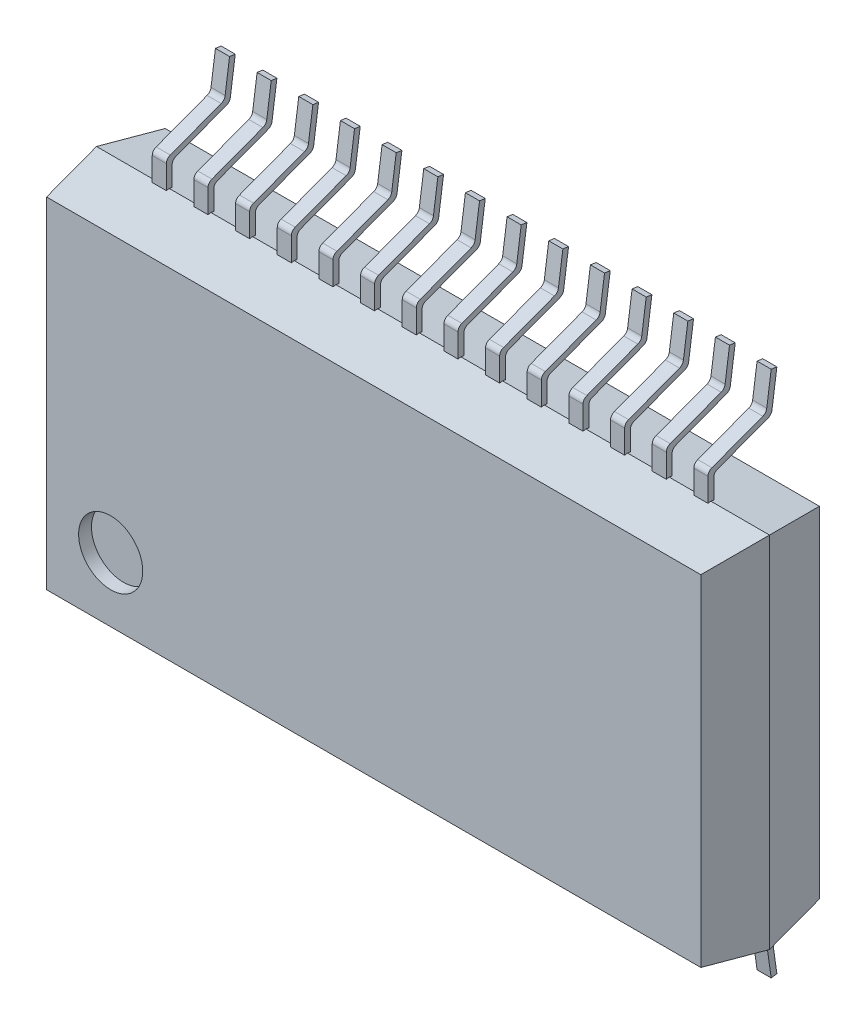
from build123d import *

# Parameters (mm, degrees)
ESBO_O1_W                  = 10.5
ESBO_O1_H                  = 5.6
EXTRUS_O1_DEPTH            = 0.925
EXTRUS_O1_TAPER            = 9
ESBO_O2_W                  = 10.5
ESBO_O2_H                  = 5.6
EXTRUS_O2_DEPTH            = 0.925
EXTRUS_O2_DRAFT            = -9
EXTRUS_O3_DEPTH            = 0.22
EXTRUS_O3_2_DEPTH          = 0.22
PADR_O_LINEAR2_COUNT       = 14
PADR_O_LINEAR2_PITCH       = 0.65
CORTE_EXTRUS_O1_DEPTH      = 0.2
CORTE_EXTRUS_O1_DEPTH_BACK = 0.2
CORTE_EXTRUS_O1_START      = 0.925
ESBO_O7_R                  = 0.5


with BuildPart() as part:
    # Esbo_o1 → Extrus_o1 (new body)
    with BuildSketch(Plane.XY):
        with Locations((4.335, 2.8)):
            Rectangle(ESBO_O1_W, ESBO_O1_H)
    extrude(amount=EXTRUS_O1_DEPTH, taper=EXTRUS_O1_TAPER)

    # Esbo_o7 → Corte-extrus_o1 (cut, two sides: drawn at the far end of the back side and taken through both)
    with BuildSketch(Plane.XY.offset(CORTE_EXTRUS_O1_START - CORTE_EXTRUS_O1_DEPTH_BACK)):
        with Locations((0.231505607, 1.146505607)):
            Circle(ESBO_O7_R)
    extrude(amount=CORTE_EXTRUS_O1_DEPTH + CORTE_EXTRUS_O1_DEPTH_BACK, mode=Mode.SUBTRACT)


with BuildPart() as body_2:
    # Esbo_o2 → Extrus_o2 (with draft: the straight prism first)
    with BuildSketch(Plane.XY):
        with Locations((4.335, 2.8)):
            Rectangle(ESBO_O2_W, ESBO_O2_H)
    extrude(amount=-EXTRUS_O2_DEPTH)
    # Extrus_o2: the draft: its side faces are tilted about the plane it starts from
    extrus_o2_sides = [body_2.faces().sort_by_distance(p)[0] for p in [
        (-0.915, 2.8, -0.4625),
        (4.335, 0, -0.4625),
        (9.585, 2.8, -0.4625),
        (4.335, 5.6, -0.4625),
    ]]
    draft(extrus_o2_sides, Plane.XY, EXTRUS_O2_DRAFT)


with BuildPart() as body_3:
    # Esbo_o3 → Extrus_o3 (new body)
    with BuildSketch(Plane(origin=(0, 0, 0), x_dir=(0, 0, -1), z_dir=(1, 0, 0))):
        with BuildLine():
            Line((1.03, 6.9), (0.940875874, 6.912525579))
            Line((0.940875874, 6.912525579), (0.871853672, 6.421407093))
            ThreePointArc((0.871853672, 6.421407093), (0.85269388, 6.372952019), (0.810404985, 6.342511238))
            Line((0.810404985, 6.342511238), (0.016401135, 6.04365025))
            ThreePointArc((0.016401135, 6.04365025), (-0.028486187, 6.011150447), (-0.045, 5.958250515))
            Line((-0.045, 5.958250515), (-0.045, 5.5928727))
            Line((-0.045, 5.5928727), (0, 5.6))
            Line((0, 5.6), (0.045, 5.5928727))
            Line((0.045, 5.5928727), (0.045, 5.895962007))
            ThreePointArc((0.045, 5.895962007), (0.061513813, 5.94886194), (0.106401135, 5.981361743))
            Line((0.106401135, 5.981361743), (0.895282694, 6.278294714))
            ThreePointArc((0.895282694, 6.278294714), (0.933531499, 6.306508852), (0.952702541, 6.35))
            Line((0.952702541, 6.35), (1.03, 6.9))
        make_face()
    extrude(amount=EXTRUS_O3_DEPTH)


with BuildPart() as body_4:
    # Esbo_o3 → Extrus_o3 2 (new body)
    with BuildSketch(Plane(origin=(0, 0, 0), x_dir=(0, 0, -1), z_dir=(1, 0, 0))):
        with BuildLine():
            Line((0, 0), (0.045, 0.0071273))
            Line((0.045, 0.0071273), (0.045, -0.295962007))
            ThreePointArc((0.045, -0.295962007), (0.061513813, -0.34886194), (0.106401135, -0.381361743))
            Line((0.106401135, -0.381361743), (0.895282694, -0.678294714))
            ThreePointArc((0.895282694, -0.678294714), (0.933531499, -0.706508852), (0.952702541, -0.75))
            Line((0.952702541, -0.75), (1.03, -1.3))
            Line((1.03, -1.3), (0.940875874, -1.312525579))
            Line((0.940875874, -1.312525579), (0.871853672, -0.821407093))
            ThreePointArc((0.871853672, -0.821407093), (0.85269388, -0.772952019), (0.810404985, -0.742511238))
            Line((0.810404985, -0.742511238), (0.016401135, -0.44365025))
            ThreePointArc((0.016401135, -0.44365025), (-0.028486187, -0.411150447), (-0.045, -0.358250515))
            Line((-0.045, -0.358250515), (-0.045, 0.0071273))
            Line((-0.045, 0.0071273), (0, 0))
        make_face()
    extrude(amount=EXTRUS_O3_2_DEPTH)


with BuildPart() as padr_o_linear2_1:
    # Padr_o linear2: pattern copy
    add(body_4.part.moved(Location(Vector(1, 0, 0) * (1 * PADR_O_LINEAR2_PITCH))))


with BuildPart() as padr_o_linear2_2:
    # Padr_o linear2: pattern copy
    add(body_4.part.moved(Location(Vector(1, 0, 0) * (2 * PADR_O_LINEAR2_PITCH))))


with BuildPart() as padr_o_linear2_3:
    # Padr_o linear2: pattern copy
    add(body_4.part.moved(Location(Vector(1, 0, 0) * (3 * PADR_O_LINEAR2_PITCH))))


with BuildPart() as padr_o_linear2_4:
    # Padr_o linear2: pattern copy
    add(body_4.part.moved(Location(Vector(1, 0, 0) * (4 * PADR_O_LINEAR2_PITCH))))


with BuildPart() as padr_o_linear2_5:
    # Padr_o linear2: pattern copy
    add(body_4.part.moved(Location(Vector(1, 0, 0) * (5 * PADR_O_LINEAR2_PITCH))))


with BuildPart() as padr_o_linear2_6:
    # Padr_o linear2: pattern copy
    add(body_4.part.moved(Location(Vector(1, 0, 0) * (6 * PADR_O_LINEAR2_PITCH))))


with BuildPart() as padr_o_linear2_7:
    # Padr_o linear2: pattern copy
    add(body_4.part.moved(Location(Vector(1, 0, 0) * (7 * PADR_O_LINEAR2_PITCH))))


with BuildPart() as padr_o_linear2_8:
    # Padr_o linear2: pattern copy
    add(body_4.part.moved(Location(Vector(1, 0, 0) * (8 * PADR_O_LINEAR2_PITCH))))


with BuildPart() as padr_o_linear2_9:
    # Padr_o linear2: pattern copy
    add(body_4.part.moved(Location(Vector(1, 0, 0) * (9 * PADR_O_LINEAR2_PITCH))))


with BuildPart() as padr_o_linear2_10:
    # Padr_o linear2: pattern copy
    add(body_4.part.moved(Location(Vector(1, 0, 0) * (10 * PADR_O_LINEAR2_PITCH))))


with BuildPart() as padr_o_linear2_11:
    # Padr_o linear2: pattern copy
    add(body_4.part.moved(Location(Vector(1, 0, 0) * (11 * PADR_O_LINEAR2_PITCH))))


with BuildPart() as padr_o_linear2_12:
    # Padr_o linear2: pattern copy
    add(body_4.part.moved(Location(Vector(1, 0, 0) * (12 * PADR_O_LINEAR2_PITCH))))


with BuildPart() as padr_o_linear2_13:
    # Padr_o linear2: pattern copy
    add(body_4.part.moved(Location(Vector(1, 0, 0) * (13 * PADR_O_LINEAR2_PITCH))))


with BuildPart() as padr_o_linear2_14:
    # Padr_o linear2: pattern copy
    add(body_3.part.moved(Location(Vector(1, 0, 0) * (1 * PADR_O_LINEAR2_PITCH))))


with BuildPart() as padr_o_linear2_15:
    # Padr_o linear2: pattern copy
    add(body_3.part.moved(Location(Vector(1, 0, 0) * (2 * PADR_O_LINEAR2_PITCH))))


with BuildPart() as padr_o_linear2_16:
    # Padr_o linear2: pattern copy
    add(body_3.part.moved(Location(Vector(1, 0, 0) * (3 * PADR_O_LINEAR2_PITCH))))


with BuildPart() as padr_o_linear2_17:
    # Padr_o linear2: pattern copy
    add(body_3.part.moved(Location(Vector(1, 0, 0) * (4 * PADR_O_LINEAR2_PITCH))))


with BuildPart() as padr_o_linear2_18:
    # Padr_o linear2: pattern copy
    add(body_3.part.moved(Location(Vector(1, 0, 0) * (5 * PADR_O_LINEAR2_PITCH))))


with BuildPart() as padr_o_linear2_19:
    # Padr_o linear2: pattern copy
    add(body_3.part.moved(Location(Vector(1, 0, 0) * (6 * PADR_O_LINEAR2_PITCH))))


with BuildPart() as padr_o_linear2_20:
    # Padr_o linear2: pattern copy
    add(body_3.part.moved(Location(Vector(1, 0, 0) * (7 * PADR_O_LINEAR2_PITCH))))


with BuildPart() as padr_o_linear2_21:
    # Padr_o linear2: pattern copy
    add(body_3.part.moved(Location(Vector(1, 0, 0) * (8 * PADR_O_LINEAR2_PITCH))))


with BuildPart() as padr_o_linear2_22:
    # Padr_o linear2: pattern copy
    add(body_3.part.moved(Location(Vector(1, 0, 0) * (9 * PADR_O_LINEAR2_PITCH))))


with BuildPart() as padr_o_linear2_23:
    # Padr_o linear2: pattern copy
    add(body_3.part.moved(Location(Vector(1, 0, 0) * (10 * PADR_O_LINEAR2_PITCH))))


with BuildPart() as padr_o_linear2_24:
    # Padr_o linear2: pattern copy
    add(body_3.part.moved(Location(Vector(1, 0, 0) * (11 * PADR_O_LINEAR2_PITCH))))


with BuildPart() as padr_o_linear2_25:
    # Padr_o linear2: pattern copy
    add(body_3.part.moved(Location(Vector(1, 0, 0) * (12 * PADR_O_LINEAR2_PITCH))))


with BuildPart() as padr_o_linear2_26:
    # Padr_o linear2: pattern copy
    add(body_3.part.moved(Location(Vector(1, 0, 0) * (13 * PADR_O_LINEAR2_PITCH))))


solid = Compound([part.part, body_2.part, body_3.part, body_4.part, padr_o_linear2_1.part, padr_o_linear2_2.part, padr_o_linear2_3.part, padr_o_linear2_4.part, padr_o_linear2_5.part, padr_o_linear2_6.part, padr_o_linear2_7.part, padr_o_linear2_8.part, padr_o_linear2_9.part, padr_o_linear2_10.part, padr_o_linear2_11.part, padr_o_linear2_12.part, padr_o_linear2_13.part, padr_o_linear2_14.part, padr_o_linear2_15.part, padr_o_linear2_16.part, padr_o_linear2_17.part, padr_o_linear2_18.part, padr_o_linear2_19.part, padr_o_linear2_20.part, padr_o_linear2_21.part, padr_o_linear2_22.part, padr_o_linear2_23.part, padr_o_linear2_24.part, padr_o_linear2_25.part, padr_o_linear2_26.part])
